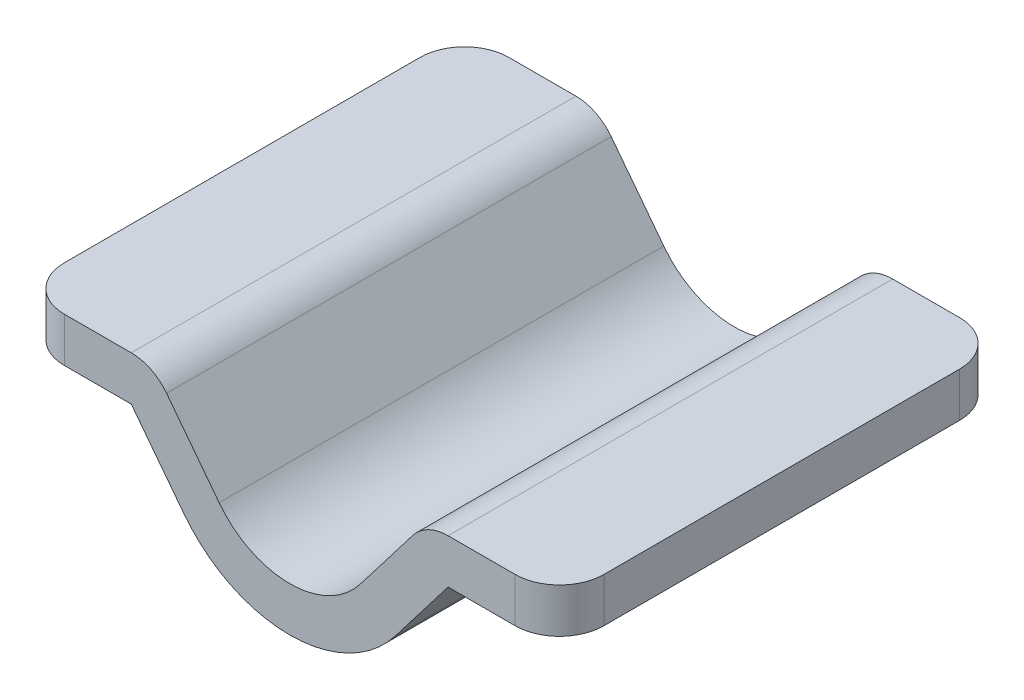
ISO-10303-21;
HEADER;
FILE_DESCRIPTION(('STEP AP214'),'2;1');
FILE_NAME('part.step','',(''),(''),'','','');
FILE_SCHEMA(('AUTOMOTIVE_DESIGN { 1 0 10303 214 1 1 1 1 }'));
ENDSEC;
DATA;
#1=APPLICATION_CONTEXT('core data for automotive mechanical design processes');
#2=APPLICATION_PROTOCOL_DEFINITION('international standard','automotive_design',2000,#1);
#3=PRODUCT_CONTEXT('',#1,'mechanical');
#4=PRODUCT('Part','Part','',(#3));
#5=PRODUCT_RELATED_PRODUCT_CATEGORY('part','',(#4));
#6=PRODUCT_DEFINITION_FORMATION('','',#4);
#7=PRODUCT_DEFINITION_CONTEXT('part definition',#1,'design');
#8=PRODUCT_DEFINITION('design','',#6,#7);
#9=PRODUCT_DEFINITION_SHAPE('','',#8);
#10=(LENGTH_UNIT() NAMED_UNIT(*) SI_UNIT(.MILLI.,.METRE.));
#11=(NAMED_UNIT(*) PLANE_ANGLE_UNIT() SI_UNIT($,.RADIAN.));
#12=(NAMED_UNIT(*) SI_UNIT($,.STERADIAN.) SOLID_ANGLE_UNIT());
#13=UNCERTAINTY_MEASURE_WITH_UNIT(LENGTH_MEASURE(1.E-05),#10,'distance_accuracy_value','');
#14=(GEOMETRIC_REPRESENTATION_CONTEXT(3) GLOBAL_UNCERTAINTY_ASSIGNED_CONTEXT((#13)) GLOBAL_UNIT_ASSIGNED_CONTEXT((#10,
#11,#12)) REPRESENTATION_CONTEXT('',''));
#15=CARTESIAN_POINT('',(0.,0.,0.));
#16=DIRECTION('',(0.,0.,1.));
#17=DIRECTION('',(1.,0.,0.));
#18=AXIS2_PLACEMENT_3D('',#15,#16,#17);
#19=CARTESIAN_POINT('',(90.4863157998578,76.2,127.));
#20=DIRECTION('',(0.,1.,0.));
#21=DIRECTION('',(-1.,0.,0.));
#22=AXIS2_PLACEMENT_3D('',#19,#20,#21);
#23=PLANE('',#22);
#24=DIRECTION('',(0.,0.,-1.));
#25=VECTOR('',#24,1.);
#26=CARTESIAN_POINT('',(154.160421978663,76.2,127.));
#27=LINE('',#26,#25);
#28=CARTESIAN_POINT('',(154.160421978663,76.2,101.6));
#29=VERTEX_POINT('',#28);
#30=CARTESIAN_POINT('',(154.160421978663,76.2,-101.6));
#31=VERTEX_POINT('',#30);
#32=EDGE_CURVE('E266',#29,#31,#27,.T.);
#33=ORIENTED_EDGE('',*,*,#32,.F.);
#34=CARTESIAN_POINT('',(128.760421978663,76.2,101.6));
#35=DIRECTION('',(0.,1.,0.));
#36=DIRECTION('',(-1.,0.,0.));
#37=AXIS2_PLACEMENT_3D('',#34,#35,#36);
#38=CIRCLE('',#37,25.4);
#39=CARTESIAN_POINT('',(128.760421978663,76.2,127.));
#40=VERTEX_POINT('',#39);
#41=EDGE_CURVE('E276',#29,#40,#38,.F.);
#42=ORIENTED_EDGE('',*,*,#41,.T.);
#43=DIRECTION('',(1.,0.,0.));
#44=VECTOR('',#43,1.);
#45=CARTESIAN_POINT('',(90.4863157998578,76.2,127.));
#46=LINE('',#45,#44);
#47=CARTESIAN_POINT('',(90.4863157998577,76.2,127.));
#48=VERTEX_POINT('',#47);
#49=EDGE_CURVE('E183',#48,#40,#46,.T.);
#50=ORIENTED_EDGE('',*,*,#49,.F.);
#51=DIRECTION('',(0.,0.,-1.));
#52=VECTOR('',#51,1.);
#53=CARTESIAN_POINT('',(90.4863157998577,76.2,127.));
#54=LINE('',#53,#52);
#55=CARTESIAN_POINT('',(90.4863157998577,76.2,-127.));
#56=VERTEX_POINT('',#55);
#57=EDGE_CURVE('E210',#48,#56,#54,.T.);
#58=ORIENTED_EDGE('',*,*,#57,.T.);
#59=DIRECTION('',(1.,0.,0.));
#60=VECTOR('',#59,1.);
#61=CARTESIAN_POINT('',(90.4863157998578,76.2,-127.));
#62=LINE('',#61,#60);
#63=CARTESIAN_POINT('',(128.760421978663,76.2,-127.));
#64=VERTEX_POINT('',#63);
#65=EDGE_CURVE('E211',#56,#64,#62,.T.);
#66=ORIENTED_EDGE('',*,*,#65,.T.);
#67=CARTESIAN_POINT('',(128.760421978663,76.2,-101.6));
#68=DIRECTION('',(0.,1.,0.));
#69=DIRECTION('',(-1.,0.,0.));
#70=AXIS2_PLACEMENT_3D('',#67,#68,#69);
#71=CIRCLE('',#70,25.4);
#72=EDGE_CURVE('E274',#64,#31,#71,.F.);
#73=ORIENTED_EDGE('',*,*,#72,.T.);
#74=EDGE_LOOP('',(#33,#42,#50,#58,#66,#73));
#75=FACE_BOUND('',#74,.T.);
#76=ADVANCED_FACE('F35',(#75),#23,.F.);
#77=CARTESIAN_POINT('',(154.160421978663,101.6,127.));
#78=DIRECTION('',(1.,0.,0.));
#79=DIRECTION('',(0.,0.,-1.));
#80=AXIS2_PLACEMENT_3D('',#77,#78,#79);
#81=PLANE('',#80);
#82=DIRECTION('',(0.,0.,-1.));
#83=VECTOR('',#82,1.);
#84=CARTESIAN_POINT('',(154.160421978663,101.6,127.));
#85=LINE('',#84,#83);
#86=CARTESIAN_POINT('',(154.160421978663,101.6,101.6));
#87=VERTEX_POINT('',#86);
#88=CARTESIAN_POINT('',(154.160421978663,101.6,-101.6));
#89=VERTEX_POINT('',#88);
#90=EDGE_CURVE('E171',#87,#89,#85,.T.);
#91=ORIENTED_EDGE('',*,*,#90,.F.);
#92=DIRECTION('',(0.,-1.,0.));
#93=VECTOR('',#92,1.);
#94=CARTESIAN_POINT('',(154.160421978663,76.2,101.6));
#95=LINE('',#94,#93);
#96=EDGE_CURVE('E271',#87,#29,#95,.T.);
#97=ORIENTED_EDGE('',*,*,#96,.T.);
#98=ORIENTED_EDGE('',*,*,#32,.T.);
#99=DIRECTION('',(0.,-1.,0.));
#100=VECTOR('',#99,1.);
#101=CARTESIAN_POINT('',(154.160421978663,101.6,-101.6));
#102=LINE('',#101,#100);
#103=EDGE_CURVE('E269',#31,#89,#102,.F.);
#104=ORIENTED_EDGE('',*,*,#103,.T.);
#105=EDGE_LOOP('',(#91,#97,#98,#104));
#106=FACE_BOUND('',#105,.T.);
#107=ADVANCED_FACE('F330',(#106),#81,.T.);
#108=CARTESIAN_POINT('',(90.4863157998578,101.6,127.));
#109=DIRECTION('',(0.,1.,0.));
#110=DIRECTION('',(-1.,0.,0.));
#111=AXIS2_PLACEMENT_3D('',#108,#109,#110);
#112=PLANE('',#111);
#113=DIRECTION('',(1.,0.,0.));
#114=VECTOR('',#113,1.);
#115=CARTESIAN_POINT('',(90.4863157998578,101.6,127.));
#116=LINE('',#115,#114);
#117=CARTESIAN_POINT('',(90.4863157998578,101.6,127.));
#118=VERTEX_POINT('',#117);
#119=CARTESIAN_POINT('',(128.760421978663,101.6,127.));
#120=VERTEX_POINT('',#119);
#121=EDGE_CURVE('E163',#118,#120,#116,.T.);
#122=ORIENTED_EDGE('',*,*,#121,.T.);
#123=CARTESIAN_POINT('',(128.760421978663,101.6,101.6));
#124=DIRECTION('',(0.,1.,0.));
#125=DIRECTION('',(-1.,0.,0.));
#126=AXIS2_PLACEMENT_3D('',#123,#124,#125);
#127=CIRCLE('',#126,25.4);
#128=EDGE_CURVE('E283',#120,#87,#127,.T.);
#129=ORIENTED_EDGE('',*,*,#128,.T.);
#130=ORIENTED_EDGE('',*,*,#90,.T.);
#131=CARTESIAN_POINT('',(128.760421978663,101.6,-101.6));
#132=DIRECTION('',(0.,1.,0.));
#133=DIRECTION('',(-1.,0.,0.));
#134=AXIS2_PLACEMENT_3D('',#131,#132,#133);
#135=CIRCLE('',#134,25.4);
#136=CARTESIAN_POINT('',(128.760421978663,101.6,-127.));
#137=VERTEX_POINT('',#136);
#138=EDGE_CURVE('E281',#89,#137,#135,.T.);
#139=ORIENTED_EDGE('',*,*,#138,.T.);
#140=DIRECTION('',(1.,0.,0.));
#141=VECTOR('',#140,1.);
#142=CARTESIAN_POINT('',(90.4863157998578,101.6,-127.));
#143=LINE('',#142,#141);
#144=CARTESIAN_POINT('',(90.4863157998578,101.6,-127.));
#145=VERTEX_POINT('',#144);
#146=EDGE_CURVE('E166',#145,#137,#143,.T.);
#147=ORIENTED_EDGE('',*,*,#146,.F.);
#148=DIRECTION('',(0.,0.,-1.));
#149=VECTOR('',#148,1.);
#150=CARTESIAN_POINT('',(90.4863157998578,101.6,127.));
#151=LINE('',#150,#149);
#152=EDGE_CURVE('E160',#118,#145,#151,.T.);
#153=ORIENTED_EDGE('',*,*,#152,.F.);
#154=EDGE_LOOP('',(#122,#129,#130,#139,#147,#153));
#155=FACE_BOUND('',#154,.T.);
#156=ADVANCED_FACE('F162',(#155),#112,.T.);
#157=CARTESIAN_POINT('',(90.4863157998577,76.2,127.));
#158=DIRECTION('',(0.,0.,-1.));
#159=DIRECTION('',(-1.,0.,0.));
#160=AXIS2_PLACEMENT_3D('',#157,#158,#159);
#161=CYLINDRICAL_SURFACE('',#160,25.4);
#162=CARTESIAN_POINT('',(90.4863157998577,76.2,-127.));
#163=DIRECTION('',(0.,0.,-1.));
#164=DIRECTION('',(1.,0.,0.));
#165=AXIS2_PLACEMENT_3D('',#162,#163,#164);
#166=CIRCLE('',#165,25.4);
#167=CARTESIAN_POINT('',(70.3351409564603,91.6625402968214,-127.));
#168=VERTEX_POINT('',#167);
#169=EDGE_CURVE('E215',#168,#145,#166,.T.);
#170=ORIENTED_EDGE('',*,*,#169,.F.);
#171=DIRECTION('',(0.,0.,-1.));
#172=VECTOR('',#171,1.);
#173=CARTESIAN_POINT('',(70.3351409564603,91.6625402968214,127.));
#174=LINE('',#173,#172);
#175=CARTESIAN_POINT('',(70.3351409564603,91.6625402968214,127.));
#176=VERTEX_POINT('',#175);
#177=EDGE_CURVE('E172',#176,#168,#174,.T.);
#178=ORIENTED_EDGE('',*,*,#177,.F.);
#179=CARTESIAN_POINT('',(90.4863157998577,76.2,127.));
#180=DIRECTION('',(0.,0.,-1.));
#181=DIRECTION('',(1.,0.,0.));
#182=AXIS2_PLACEMENT_3D('',#179,#180,#181);
#183=CIRCLE('',#182,25.4);
#184=EDGE_CURVE('E179',#176,#118,#183,.T.);
#185=ORIENTED_EDGE('',*,*,#184,.T.);
#186=ORIENTED_EDGE('',*,*,#152,.T.);
#187=EDGE_LOOP('',(#170,#178,#185,#186));
#188=FACE_BOUND('',#187,.T.);
#189=ADVANCED_FACE('F185',(#188),#161,.T.);
#190=CARTESIAN_POINT('',(40.3023496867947,52.5230446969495,127.));
#191=DIRECTION('',(-0.793353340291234,0.608761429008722,0.));
#192=DIRECTION('',(-0.608761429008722,-0.793353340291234,0.));
#193=AXIS2_PLACEMENT_3D('',#190,#191,#192);
#194=PLANE('',#193);
#195=DIRECTION('',(0.608761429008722,0.793353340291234,0.));
#196=VECTOR('',#195,1.);
#197=CARTESIAN_POINT('',(40.3023496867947,52.5230446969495,-127.));
#198=LINE('',#197,#196);
#199=CARTESIAN_POINT('',(40.3023496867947,52.5230446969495,-127.));
#200=VERTEX_POINT('',#199);
#201=EDGE_CURVE('E217',#200,#168,#198,.T.);
#202=ORIENTED_EDGE('',*,*,#201,.F.);
#203=DIRECTION('',(0.,0.,-1.));
#204=VECTOR('',#203,1.);
#205=CARTESIAN_POINT('',(40.3023496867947,52.5230446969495,127.));
#206=LINE('',#205,#204);
#207=CARTESIAN_POINT('',(40.3023496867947,52.5230446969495,127.));
#208=VERTEX_POINT('',#207);
#209=EDGE_CURVE('E261',#208,#200,#206,.T.);
#210=ORIENTED_EDGE('',*,*,#209,.F.);
#211=DIRECTION('',(0.608761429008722,0.793353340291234,0.));
#212=VECTOR('',#211,1.);
#213=CARTESIAN_POINT('',(40.3023496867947,52.5230446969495,127.));
#214=LINE('',#213,#212);
#215=EDGE_CURVE('E186',#208,#176,#214,.T.);
#216=ORIENTED_EDGE('',*,*,#215,.T.);
#217=ORIENTED_EDGE('',*,*,#177,.T.);
#218=EDGE_LOOP('',(#202,#210,#216,#217));
#219=FACE_BOUND('',#218,.T.);
#220=ADVANCED_FACE('F357',(#219),#194,.T.);
#221=CARTESIAN_POINT('',(0.,83.4481252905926,127.));
#222=DIRECTION('',(0.,0.,-1.));
#223=DIRECTION('',(-1.,0.,0.));
#224=AXIS2_PLACEMENT_3D('',#221,#222,#223);
#225=CYLINDRICAL_SURFACE('',#224,50.8);
#226=CARTESIAN_POINT('',(0.,83.4481252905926,-127.));
#227=DIRECTION('',(0.,0.,1.));
#228=DIRECTION('',(1.,0.,0.));
#229=AXIS2_PLACEMENT_3D('',#226,#227,#228);
#230=CIRCLE('',#229,50.8);
#231=CARTESIAN_POINT('',(-40.3023496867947,52.5230446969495,-127.));
#232=VERTEX_POINT('',#231);
#233=EDGE_CURVE('E220',#232,#200,#230,.T.);
#234=ORIENTED_EDGE('',*,*,#233,.F.);
#235=DIRECTION('',(0.,0.,-1.));
#236=VECTOR('',#235,1.);
#237=CARTESIAN_POINT('',(-40.3023496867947,52.5230446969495,127.));
#238=LINE('',#237,#236);
#239=CARTESIAN_POINT('',(-40.3023496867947,52.5230446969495,127.));
#240=VERTEX_POINT('',#239);
#241=EDGE_CURVE('E259',#240,#232,#238,.T.);
#242=ORIENTED_EDGE('',*,*,#241,.F.);
#243=CARTESIAN_POINT('',(0.,83.4481252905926,127.));
#244=DIRECTION('',(0.,0.,1.));
#245=DIRECTION('',(1.,0.,0.));
#246=AXIS2_PLACEMENT_3D('',#243,#244,#245);
#247=CIRCLE('',#246,50.8);
#248=EDGE_CURVE('E188',#240,#208,#247,.T.);
#249=ORIENTED_EDGE('',*,*,#248,.T.);
#250=ORIENTED_EDGE('',*,*,#209,.T.);
#251=EDGE_LOOP('',(#234,#242,#249,#250));
#252=FACE_BOUND('',#251,.T.);
#253=ADVANCED_FACE('F361',(#252),#225,.F.);
#254=CARTESIAN_POINT('',(-40.3023496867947,52.5230446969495,127.));
#255=DIRECTION('',(0.793353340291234,0.608761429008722,0.));
#256=DIRECTION('',(-0.608761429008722,0.793353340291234,0.));
#257=AXIS2_PLACEMENT_3D('',#254,#255,#256);
#258=PLANE('',#257);
#259=DIRECTION('',(0.608761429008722,-0.793353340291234,0.));
#260=VECTOR('',#259,1.);
#261=CARTESIAN_POINT('',(-40.3023496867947,52.5230446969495,-127.));
#262=LINE('',#261,#260);
#263=CARTESIAN_POINT('',(-70.3351409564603,91.6625402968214,-127.));
#264=VERTEX_POINT('',#263);
#265=EDGE_CURVE('E223',#264,#232,#262,.T.);
#266=ORIENTED_EDGE('',*,*,#265,.F.);
#267=DIRECTION('',(0.,0.,-1.));
#268=VECTOR('',#267,1.);
#269=CARTESIAN_POINT('',(-70.3351409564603,91.6625402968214,127.));
#270=LINE('',#269,#268);
#271=CARTESIAN_POINT('',(-70.3351409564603,91.6625402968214,127.));
#272=VERTEX_POINT('',#271);
#273=EDGE_CURVE('E257',#272,#264,#270,.T.);
#274=ORIENTED_EDGE('',*,*,#273,.F.);
#275=DIRECTION('',(0.608761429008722,-0.793353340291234,0.));
#276=VECTOR('',#275,1.);
#277=CARTESIAN_POINT('',(-40.3023496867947,52.5230446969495,127.));
#278=LINE('',#277,#276);
#279=EDGE_CURVE('E194',#272,#240,#278,.T.);
#280=ORIENTED_EDGE('',*,*,#279,.T.);
#281=ORIENTED_EDGE('',*,*,#241,.T.);
#282=EDGE_LOOP('',(#266,#274,#280,#281));
#283=FACE_BOUND('',#282,.T.);
#284=ADVANCED_FACE('F364',(#283),#258,.T.);
#285=CARTESIAN_POINT('',(-90.4863157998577,76.2,127.));
#286=DIRECTION('',(0.,0.,-1.));
#287=DIRECTION('',(-1.,0.,0.));
#288=AXIS2_PLACEMENT_3D('',#285,#286,#287);
#289=CYLINDRICAL_SURFACE('',#288,25.4);
#290=CARTESIAN_POINT('',(-90.4863157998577,76.2,-127.));
#291=DIRECTION('',(0.,0.,-1.));
#292=DIRECTION('',(1.,0.,0.));
#293=AXIS2_PLACEMENT_3D('',#290,#291,#292);
#294=CIRCLE('',#293,25.4);
#295=CARTESIAN_POINT('',(-90.4863157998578,101.6,-127.));
#296=VERTEX_POINT('',#295);
#297=EDGE_CURVE('E226',#296,#264,#294,.T.);
#298=ORIENTED_EDGE('',*,*,#297,.F.);
#299=DIRECTION('',(0.,0.,-1.));
#300=VECTOR('',#299,1.);
#301=CARTESIAN_POINT('',(-90.4863157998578,101.6,127.));
#302=LINE('',#301,#300);
#303=CARTESIAN_POINT('',(-90.4863157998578,101.6,127.));
#304=VERTEX_POINT('',#303);
#305=EDGE_CURVE('E254',#304,#296,#302,.T.);
#306=ORIENTED_EDGE('',*,*,#305,.F.);
#307=CARTESIAN_POINT('',(-90.4863157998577,76.2,127.));
#308=DIRECTION('',(0.,0.,-1.));
#309=DIRECTION('',(1.,0.,0.));
#310=AXIS2_PLACEMENT_3D('',#307,#308,#309);
#311=CIRCLE('',#310,25.4);
#312=EDGE_CURVE('E197',#304,#272,#311,.T.);
#313=ORIENTED_EDGE('',*,*,#312,.T.);
#314=ORIENTED_EDGE('',*,*,#273,.T.);
#315=EDGE_LOOP('',(#298,#306,#313,#314));
#316=FACE_BOUND('',#315,.T.);
#317=ADVANCED_FACE('F369',(#316),#289,.T.);
#318=CARTESIAN_POINT('',(-90.4863157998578,101.6,127.));
#319=DIRECTION('',(0.,1.,0.));
#320=DIRECTION('',(-1.,0.,0.));
#321=AXIS2_PLACEMENT_3D('',#318,#319,#320);
#322=PLANE('',#321);
#323=DIRECTION('',(1.,0.,0.));
#324=VECTOR('',#323,1.);
#325=CARTESIAN_POINT('',(-90.4863157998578,101.6,-127.));
#326=LINE('',#325,#324);
#327=CARTESIAN_POINT('',(-128.760421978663,101.6,-127.));
#328=VERTEX_POINT('',#327);
#329=EDGE_CURVE('E229',#328,#296,#326,.T.);
#330=ORIENTED_EDGE('',*,*,#329,.F.);
#331=CARTESIAN_POINT('',(-128.760421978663,101.6,-101.6));
#332=DIRECTION('',(0.,1.,0.));
#333=DIRECTION('',(-1.,0.,0.));
#334=AXIS2_PLACEMENT_3D('',#331,#332,#333);
#335=CIRCLE('',#334,25.4);
#336=CARTESIAN_POINT('',(-154.160421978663,101.6,-101.6));
#337=VERTEX_POINT('',#336);
#338=EDGE_CURVE('E293',#328,#337,#335,.T.);
#339=ORIENTED_EDGE('',*,*,#338,.T.);
#340=DIRECTION('',(0.,0.,-1.));
#341=VECTOR('',#340,1.);
#342=CARTESIAN_POINT('',(-154.160421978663,101.6,127.));
#343=LINE('',#342,#341);
#344=CARTESIAN_POINT('',(-154.160421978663,101.6,101.6));
#345=VERTEX_POINT('',#344);
#346=EDGE_CURVE('E252',#345,#337,#343,.T.);
#347=ORIENTED_EDGE('',*,*,#346,.F.);
#348=CARTESIAN_POINT('',(-128.760421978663,101.6,101.6));
#349=DIRECTION('',(0.,1.,0.));
#350=DIRECTION('',(-1.,0.,0.));
#351=AXIS2_PLACEMENT_3D('',#348,#349,#350);
#352=CIRCLE('',#351,25.4);
#353=CARTESIAN_POINT('',(-128.760421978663,101.6,127.));
#354=VERTEX_POINT('',#353);
#355=EDGE_CURVE('E291',#345,#354,#352,.T.);
#356=ORIENTED_EDGE('',*,*,#355,.T.);
#357=DIRECTION('',(1.,0.,0.));
#358=VECTOR('',#357,1.);
#359=CARTESIAN_POINT('',(-90.4863157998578,101.6,127.));
#360=LINE('',#359,#358);
#361=EDGE_CURVE('E200',#354,#304,#360,.T.);
#362=ORIENTED_EDGE('',*,*,#361,.T.);
#363=ORIENTED_EDGE('',*,*,#305,.T.);
#364=EDGE_LOOP('',(#330,#339,#347,#356,#362,#363));
#365=FACE_BOUND('',#364,.T.);
#366=ADVANCED_FACE('F304',(#365),#322,.T.);
#367=CARTESIAN_POINT('',(-154.160421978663,76.2,127.));
#368=DIRECTION('',(-1.,0.,0.));
#369=DIRECTION('',(0.,0.,1.));
#370=AXIS2_PLACEMENT_3D('',#367,#368,#369);
#371=PLANE('',#370);
#372=ORIENTED_EDGE('',*,*,#346,.T.);
#373=DIRECTION('',(0.,1.,0.));
#374=VECTOR('',#373,1.);
#375=CARTESIAN_POINT('',(-154.160421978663,76.2,-101.6));
#376=LINE('',#375,#374);
#377=CARTESIAN_POINT('',(-154.160421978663,76.2,-101.6));
#378=VERTEX_POINT('',#377);
#379=EDGE_CURVE('E50',#337,#378,#376,.F.);
#380=ORIENTED_EDGE('',*,*,#379,.T.);
#381=DIRECTION('',(0.,0.,-1.));
#382=VECTOR('',#381,1.);
#383=CARTESIAN_POINT('',(-154.160421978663,76.2,127.));
#384=LINE('',#383,#382);
#385=CARTESIAN_POINT('',(-154.160421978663,76.2,101.6));
#386=VERTEX_POINT('',#385);
#387=EDGE_CURVE('E250',#386,#378,#384,.T.);
#388=ORIENTED_EDGE('',*,*,#387,.F.);
#389=DIRECTION('',(0.,1.,0.));
#390=VECTOR('',#389,1.);
#391=CARTESIAN_POINT('',(-154.160421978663,101.6,101.6));
#392=LINE('',#391,#390);
#393=EDGE_CURVE('E295',#386,#345,#392,.T.);
#394=ORIENTED_EDGE('',*,*,#393,.T.);
#395=EDGE_LOOP('',(#372,#380,#388,#394));
#396=FACE_BOUND('',#395,.T.);
#397=ADVANCED_FACE('F300',(#396),#371,.T.);
#398=CARTESIAN_POINT('',(-90.4863157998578,76.2,127.));
#399=DIRECTION('',(0.,1.,0.));
#400=DIRECTION('',(-1.,0.,0.));
#401=AXIS2_PLACEMENT_3D('',#398,#399,#400);
#402=PLANE('',#401);
#403=ORIENTED_EDGE('',*,*,#387,.T.);
#404=CARTESIAN_POINT('',(-128.760421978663,76.2,-101.6));
#405=DIRECTION('',(0.,1.,0.));
#406=DIRECTION('',(-1.,0.,0.));
#407=AXIS2_PLACEMENT_3D('',#404,#405,#406);
#408=CIRCLE('',#407,25.4);
#409=CARTESIAN_POINT('',(-128.760421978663,76.2,-127.));
#410=VERTEX_POINT('',#409);
#411=EDGE_CURVE('E11',#378,#410,#408,.F.);
#412=ORIENTED_EDGE('',*,*,#411,.T.);
#413=DIRECTION('',(1.,0.,0.));
#414=VECTOR('',#413,1.);
#415=CARTESIAN_POINT('',(-90.4863157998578,76.2,-127.));
#416=LINE('',#415,#414);
#417=CARTESIAN_POINT('',(-90.4863157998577,76.2,-127.));
#418=VERTEX_POINT('',#417);
#419=EDGE_CURVE('E231',#410,#418,#416,.T.);
#420=ORIENTED_EDGE('',*,*,#419,.T.);
#421=DIRECTION('',(0.,0.,-1.));
#422=VECTOR('',#421,1.);
#423=CARTESIAN_POINT('',(-90.4863157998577,76.2,127.));
#424=LINE('',#423,#422);
#425=CARTESIAN_POINT('',(-90.4863157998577,76.2,127.));
#426=VERTEX_POINT('',#425);
#427=EDGE_CURVE('E247',#426,#418,#424,.T.);
#428=ORIENTED_EDGE('',*,*,#427,.F.);
#429=DIRECTION('',(1.,0.,0.));
#430=VECTOR('',#429,1.);
#431=CARTESIAN_POINT('',(-90.4863157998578,76.2,127.));
#432=LINE('',#431,#430);
#433=CARTESIAN_POINT('',(-128.760421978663,76.2,127.));
#434=VERTEX_POINT('',#433);
#435=EDGE_CURVE('E202',#434,#426,#432,.T.);
#436=ORIENTED_EDGE('',*,*,#435,.F.);
#437=CARTESIAN_POINT('',(-128.760421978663,76.2,101.6));
#438=DIRECTION('',(0.,1.,0.));
#439=DIRECTION('',(-1.,0.,0.));
#440=AXIS2_PLACEMENT_3D('',#437,#438,#439);
#441=CIRCLE('',#440,25.4);
#442=EDGE_CURVE('E43',#434,#386,#441,.F.);
#443=ORIENTED_EDGE('',*,*,#442,.T.);
#444=EDGE_LOOP('',(#403,#412,#420,#428,#436,#443));
#445=FACE_BOUND('',#444,.T.);
#446=ADVANCED_FACE('F316',(#445),#402,.F.);
#447=CARTESIAN_POINT('',(-60.453524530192,37.060504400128,127.));
#448=DIRECTION('',(0.793353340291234,0.608761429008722,0.));
#449=DIRECTION('',(-0.608761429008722,0.793353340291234,0.));
#450=AXIS2_PLACEMENT_3D('',#447,#448,#449);
#451=PLANE('',#450);
#452=DIRECTION('',(0.608761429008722,-0.793353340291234,0.));
#453=VECTOR('',#452,1.);
#454=CARTESIAN_POINT('',(-60.453524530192,37.060504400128,-127.));
#455=LINE('',#454,#453);
#456=CARTESIAN_POINT('',(-60.453524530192,37.060504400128,-127.));
#457=VERTEX_POINT('',#456);
#458=EDGE_CURVE('E233',#418,#457,#455,.T.);
#459=ORIENTED_EDGE('',*,*,#458,.T.);
#460=DIRECTION('',(0.,0.,-1.));
#461=VECTOR('',#460,1.);
#462=CARTESIAN_POINT('',(-60.453524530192,37.060504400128,127.));
#463=LINE('',#462,#461);
#464=CARTESIAN_POINT('',(-60.453524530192,37.060504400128,127.));
#465=VERTEX_POINT('',#464);
#466=EDGE_CURVE('E244',#465,#457,#463,.T.);
#467=ORIENTED_EDGE('',*,*,#466,.F.);
#468=DIRECTION('',(0.608761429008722,-0.793353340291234,0.));
#469=VECTOR('',#468,1.);
#470=CARTESIAN_POINT('',(-60.453524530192,37.060504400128,127.));
#471=LINE('',#470,#469);
#472=EDGE_CURVE('E204',#426,#465,#471,.T.);
#473=ORIENTED_EDGE('',*,*,#472,.F.);
#474=ORIENTED_EDGE('',*,*,#427,.T.);
#475=EDGE_LOOP('',(#459,#467,#473,#474));
#476=FACE_BOUND('',#475,.T.);
#477=ADVANCED_FACE('F319',(#476),#451,.F.);
#478=CARTESIAN_POINT('',(0.,83.4481252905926,127.));
#479=DIRECTION('',(0.,0.,-1.));
#480=DIRECTION('',(-1.,0.,0.));
#481=AXIS2_PLACEMENT_3D('',#478,#479,#480);
#482=CYLINDRICAL_SURFACE('',#481,76.2);
#483=CARTESIAN_POINT('',(0.,83.4481252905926,-127.));
#484=DIRECTION('',(0.,0.,1.));
#485=DIRECTION('',(1.,0.,0.));
#486=AXIS2_PLACEMENT_3D('',#483,#484,#485);
#487=CIRCLE('',#486,76.2);
#488=CARTESIAN_POINT('',(60.453524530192,37.0605044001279,-127.));
#489=VERTEX_POINT('',#488);
#490=EDGE_CURVE('E235',#457,#489,#487,.T.);
#491=ORIENTED_EDGE('',*,*,#490,.T.);
#492=DIRECTION('',(0.,0.,-1.));
#493=VECTOR('',#492,1.);
#494=CARTESIAN_POINT('',(60.453524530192,37.0605044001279,127.));
#495=LINE('',#494,#493);
#496=CARTESIAN_POINT('',(60.453524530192,37.0605044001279,127.));
#497=VERTEX_POINT('',#496);
#498=EDGE_CURVE('E241',#497,#489,#495,.T.);
#499=ORIENTED_EDGE('',*,*,#498,.F.);
#500=CARTESIAN_POINT('',(0.,83.4481252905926,127.));
#501=DIRECTION('',(0.,0.,1.));
#502=DIRECTION('',(1.,0.,0.));
#503=AXIS2_PLACEMENT_3D('',#500,#501,#502);
#504=CIRCLE('',#503,76.2);
#505=EDGE_CURVE('E206',#465,#497,#504,.T.);
#506=ORIENTED_EDGE('',*,*,#505,.F.);
#507=ORIENTED_EDGE('',*,*,#466,.T.);
#508=EDGE_LOOP('',(#491,#499,#506,#507));
#509=FACE_BOUND('',#508,.T.);
#510=ADVANCED_FACE('F421',(#509),#482,.T.);
#511=CARTESIAN_POINT('',(60.453524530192,37.060504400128,127.));
#512=DIRECTION('',(-0.793353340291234,0.608761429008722,0.));
#513=DIRECTION('',(-0.608761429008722,-0.793353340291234,0.));
#514=AXIS2_PLACEMENT_3D('',#511,#512,#513);
#515=PLANE('',#514);
#516=DIRECTION('',(0.608761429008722,0.793353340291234,0.));
#517=VECTOR('',#516,1.);
#518=CARTESIAN_POINT('',(60.453524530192,37.060504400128,-127.));
#519=LINE('',#518,#517);
#520=EDGE_CURVE('E237',#489,#56,#519,.T.);
#521=ORIENTED_EDGE('',*,*,#520,.T.);
#522=ORIENTED_EDGE('',*,*,#57,.F.);
#523=DIRECTION('',(0.608761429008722,0.793353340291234,0.));
#524=VECTOR('',#523,1.);
#525=CARTESIAN_POINT('',(60.453524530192,37.060504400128,127.));
#526=LINE('',#525,#524);
#527=EDGE_CURVE('E208',#497,#48,#526,.T.);
#528=ORIENTED_EDGE('',*,*,#527,.F.);
#529=ORIENTED_EDGE('',*,*,#498,.T.);
#530=EDGE_LOOP('',(#521,#522,#528,#529));
#531=FACE_BOUND('',#530,.T.);
#532=ADVANCED_FACE('F432',(#531),#515,.F.);
#533=CARTESIAN_POINT('',(90.4863157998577,76.2,127.));
#534=DIRECTION('',(0.,0.,-1.));
#535=DIRECTION('',(-1.,0.,0.));
#536=AXIS2_PLACEMENT_3D('',#533,#534,#535);
#537=PLANE('',#536);
#538=ORIENTED_EDGE('',*,*,#49,.T.);
#539=DIRECTION('',(0.,-1.,0.));
#540=VECTOR('',#539,1.);
#541=CARTESIAN_POINT('',(128.760421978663,101.6,127.));
#542=LINE('',#541,#540);
#543=EDGE_CURVE('E182',#40,#120,#542,.F.);
#544=ORIENTED_EDGE('',*,*,#543,.T.);
#545=ORIENTED_EDGE('',*,*,#121,.F.);
#546=ORIENTED_EDGE('',*,*,#184,.F.);
#547=ORIENTED_EDGE('',*,*,#215,.F.);
#548=ORIENTED_EDGE('',*,*,#248,.F.);
#549=ORIENTED_EDGE('',*,*,#279,.F.);
#550=ORIENTED_EDGE('',*,*,#312,.F.);
#551=ORIENTED_EDGE('',*,*,#361,.F.);
#552=DIRECTION('',(0.,1.,0.));
#553=VECTOR('',#552,1.);
#554=CARTESIAN_POINT('',(-128.760421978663,76.2,127.));
#555=LINE('',#554,#553);
#556=EDGE_CURVE('E278',#354,#434,#555,.F.);
#557=ORIENTED_EDGE('',*,*,#556,.T.);
#558=ORIENTED_EDGE('',*,*,#435,.T.);
#559=ORIENTED_EDGE('',*,*,#472,.T.);
#560=ORIENTED_EDGE('',*,*,#505,.T.);
#561=ORIENTED_EDGE('',*,*,#527,.T.);
#562=EDGE_LOOP('',(#538,#544,#545,#546,#547,#548,#549,#550,#551,#557,#558,#559,#560,#561));
#563=FACE_BOUND('',#562,.T.);
#564=ADVANCED_FACE('F177',(#563),#537,.F.);
#565=CARTESIAN_POINT('',(90.4863157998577,76.2,-127.));
#566=DIRECTION('',(0.,0.,-1.));
#567=DIRECTION('',(-1.,0.,0.));
#568=AXIS2_PLACEMENT_3D('',#565,#566,#567);
#569=PLANE('',#568);
#570=ORIENTED_EDGE('',*,*,#146,.T.);
#571=DIRECTION('',(0.,-1.,0.));
#572=VECTOR('',#571,1.);
#573=CARTESIAN_POINT('',(128.760421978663,76.2,-127.));
#574=LINE('',#573,#572);
#575=EDGE_CURVE('E288',#137,#64,#574,.T.);
#576=ORIENTED_EDGE('',*,*,#575,.T.);
#577=ORIENTED_EDGE('',*,*,#65,.F.);
#578=ORIENTED_EDGE('',*,*,#520,.F.);
#579=ORIENTED_EDGE('',*,*,#490,.F.);
#580=ORIENTED_EDGE('',*,*,#458,.F.);
#581=ORIENTED_EDGE('',*,*,#419,.F.);
#582=DIRECTION('',(0.,1.,0.));
#583=VECTOR('',#582,1.);
#584=CARTESIAN_POINT('',(-128.760421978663,76.2,-127.));
#585=LINE('',#584,#583);
#586=EDGE_CURVE('E285',#410,#328,#585,.T.);
#587=ORIENTED_EDGE('',*,*,#586,.T.);
#588=ORIENTED_EDGE('',*,*,#329,.T.);
#589=ORIENTED_EDGE('',*,*,#297,.T.);
#590=ORIENTED_EDGE('',*,*,#265,.T.);
#591=ORIENTED_EDGE('',*,*,#233,.T.);
#592=ORIENTED_EDGE('',*,*,#201,.T.);
#593=ORIENTED_EDGE('',*,*,#169,.T.);
#594=EDGE_LOOP('',(#570,#576,#577,#578,#579,#580,#581,#587,#588,#589,#590,#591,#592,#593));
#595=FACE_BOUND('',#594,.T.);
#596=ADVANCED_FACE('F312',(#595),#569,.T.);
#597=CARTESIAN_POINT('',(128.760421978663,101.6,101.6));
#598=DIRECTION('',(0.,1.,0.));
#599=DIRECTION('',(0.,0.,1.));
#600=AXIS2_PLACEMENT_3D('',#597,#598,#599);
#601=CYLINDRICAL_SURFACE('',#600,25.4);
#602=ORIENTED_EDGE('',*,*,#128,.F.);
#603=ORIENTED_EDGE('',*,*,#543,.F.);
#604=ORIENTED_EDGE('',*,*,#41,.F.);
#605=ORIENTED_EDGE('',*,*,#96,.F.);
#606=EDGE_LOOP('',(#602,#603,#604,#605));
#607=FACE_BOUND('',#606,.T.);
#608=ADVANCED_FACE('F341',(#607),#601,.T.);
#609=CARTESIAN_POINT('',(128.760421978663,76.2,-101.6));
#610=DIRECTION('',(0.,-1.,0.));
#611=DIRECTION('',(0.,0.,-1.));
#612=AXIS2_PLACEMENT_3D('',#609,#610,#611);
#613=CYLINDRICAL_SURFACE('',#612,25.4);
#614=ORIENTED_EDGE('',*,*,#138,.F.);
#615=ORIENTED_EDGE('',*,*,#103,.F.);
#616=ORIENTED_EDGE('',*,*,#72,.F.);
#617=ORIENTED_EDGE('',*,*,#575,.F.);
#618=EDGE_LOOP('',(#614,#615,#616,#617));
#619=FACE_BOUND('',#618,.T.);
#620=ADVANCED_FACE('F328',(#619),#613,.T.);
#621=CARTESIAN_POINT('',(-128.760421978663,76.2,-101.6));
#622=DIRECTION('',(0.,1.,0.));
#623=DIRECTION('',(0.,0.,1.));
#624=AXIS2_PLACEMENT_3D('',#621,#622,#623);
#625=CYLINDRICAL_SURFACE('',#624,25.4);
#626=ORIENTED_EDGE('',*,*,#411,.F.);
#627=ORIENTED_EDGE('',*,*,#379,.F.);
#628=ORIENTED_EDGE('',*,*,#338,.F.);
#629=ORIENTED_EDGE('',*,*,#586,.F.);
#630=EDGE_LOOP('',(#626,#627,#628,#629));
#631=FACE_BOUND('',#630,.T.);
#632=ADVANCED_FACE('F309',(#631),#625,.T.);
#633=CARTESIAN_POINT('',(-128.760421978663,76.2,101.6));
#634=DIRECTION('',(0.,-1.,0.));
#635=DIRECTION('',(0.,0.,-1.));
#636=AXIS2_PLACEMENT_3D('',#633,#634,#635);
#637=CYLINDRICAL_SURFACE('',#636,25.4);
#638=ORIENTED_EDGE('',*,*,#442,.F.);
#639=ORIENTED_EDGE('',*,*,#556,.F.);
#640=ORIENTED_EDGE('',*,*,#355,.F.);
#641=ORIENTED_EDGE('',*,*,#393,.F.);
#642=EDGE_LOOP('',(#638,#639,#640,#641));
#643=FACE_BOUND('',#642,.T.);
#644=ADVANCED_FACE('F37',(#643),#637,.T.);
#645=CLOSED_SHELL('',(#76,#107,#156,#189,#220,#253,#284,#317,#366,#397,#446,#477,#510,#532,#564,
#596,#608,#620,#632,#644));
#646=MANIFOLD_SOLID_BREP('B2',#645);
#647=ADVANCED_BREP_SHAPE_REPRESENTATION('',(#18,#646),#14);
#648=SHAPE_DEFINITION_REPRESENTATION(#9,#647);
ENDSEC;
END-ISO-10303-21;
